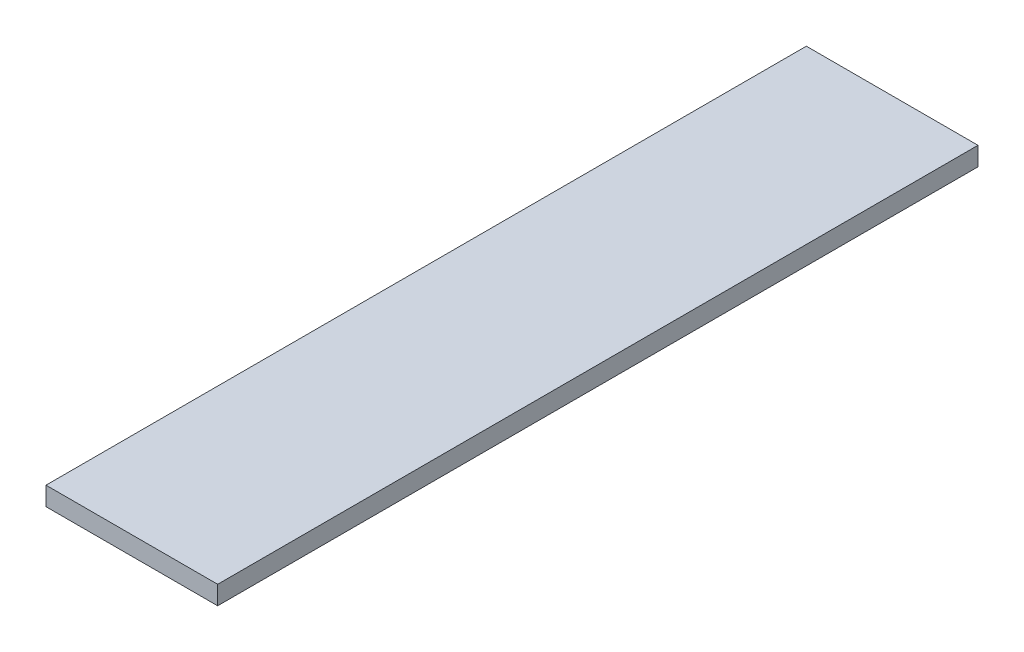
ISO-10303-21;
HEADER;
FILE_DESCRIPTION(('STEP AP214'),'2;1');
FILE_NAME('part.step','',(''),(''),'','','');
FILE_SCHEMA(('AUTOMOTIVE_DESIGN { 1 0 10303 214 1 1 1 1 }'));
ENDSEC;
DATA;
#1=APPLICATION_CONTEXT('core data for automotive mechanical design processes');
#2=APPLICATION_PROTOCOL_DEFINITION('international standard','automotive_design',2000,#1);
#3=PRODUCT_CONTEXT('',#1,'mechanical');
#4=PRODUCT('Part','Part','',(#3));
#5=PRODUCT_RELATED_PRODUCT_CATEGORY('part','',(#4));
#6=PRODUCT_DEFINITION_FORMATION('','',#4);
#7=PRODUCT_DEFINITION_CONTEXT('part definition',#1,'design');
#8=PRODUCT_DEFINITION('design','',#6,#7);
#9=PRODUCT_DEFINITION_SHAPE('','',#8);
#10=(LENGTH_UNIT() NAMED_UNIT(*) SI_UNIT(.MILLI.,.METRE.));
#11=(NAMED_UNIT(*) PLANE_ANGLE_UNIT() SI_UNIT($,.RADIAN.));
#12=(NAMED_UNIT(*) SI_UNIT($,.STERADIAN.) SOLID_ANGLE_UNIT());
#13=UNCERTAINTY_MEASURE_WITH_UNIT(LENGTH_MEASURE(1.E-05),#10,'distance_accuracy_value','');
#14=(GEOMETRIC_REPRESENTATION_CONTEXT(3) GLOBAL_UNCERTAINTY_ASSIGNED_CONTEXT((#13)) GLOBAL_UNIT_ASSIGNED_CONTEXT((#10,
#11,#12)) REPRESENTATION_CONTEXT('',''));
#15=CARTESIAN_POINT('',(0.,0.,0.));
#16=DIRECTION('',(0.,0.,1.));
#17=DIRECTION('',(1.,0.,0.));
#18=AXIS2_PLACEMENT_3D('',#15,#16,#17);
#19=CARTESIAN_POINT('',(584.2,127.,-2587.625));
#20=DIRECTION('',(-1.,0.,0.));
#21=DIRECTION('',(0.,0.,1.));
#22=AXIS2_PLACEMENT_3D('',#19,#20,#21);
#23=PLANE('',#22);
#24=DIRECTION('',(0.,0.,-1.));
#25=VECTOR('',#24,1.);
#26=CARTESIAN_POINT('',(584.2,0.,-2587.625));
#27=LINE('',#26,#25);
#28=CARTESIAN_POINT('',(584.2,0.,2587.625));
#29=VERTEX_POINT('',#28);
#30=CARTESIAN_POINT('',(584.2,0.,-2587.625));
#31=VERTEX_POINT('',#30);
#32=EDGE_CURVE('E97',#29,#31,#27,.T.);
#33=ORIENTED_EDGE('',*,*,#32,.T.);
#34=DIRECTION('',(0.,-1.,0.));
#35=VECTOR('',#34,1.);
#36=CARTESIAN_POINT('',(584.2,127.,-2587.625));
#37=LINE('',#36,#35);
#38=CARTESIAN_POINT('',(584.2,127.,-2587.625));
#39=VERTEX_POINT('',#38);
#40=EDGE_CURVE('E11',#39,#31,#37,.T.);
#41=ORIENTED_EDGE('',*,*,#40,.F.);
#42=DIRECTION('',(0.,0.,-1.));
#43=VECTOR('',#42,1.);
#44=CARTESIAN_POINT('',(584.2,127.,-2587.625));
#45=LINE('',#44,#43);
#46=CARTESIAN_POINT('',(584.2,127.,2587.625));
#47=VERTEX_POINT('',#46);
#48=EDGE_CURVE('E85',#47,#39,#45,.T.);
#49=ORIENTED_EDGE('',*,*,#48,.F.);
#50=DIRECTION('',(0.,-1.,0.));
#51=VECTOR('',#50,1.);
#52=CARTESIAN_POINT('',(584.2,127.,2587.625));
#53=LINE('',#52,#51);
#54=EDGE_CURVE('E93',#47,#29,#53,.T.);
#55=ORIENTED_EDGE('',*,*,#54,.T.);
#56=EDGE_LOOP('',(#33,#41,#49,#55));
#57=FACE_BOUND('',#56,.T.);
#58=ADVANCED_FACE('F34',(#57),#23,.F.);
#59=CARTESIAN_POINT('',(-584.2,127.,-2587.625));
#60=DIRECTION('',(0.,0.,1.));
#61=DIRECTION('',(1.,0.,0.));
#62=AXIS2_PLACEMENT_3D('',#59,#60,#61);
#63=PLANE('',#62);
#64=DIRECTION('',(-1.,0.,0.));
#65=VECTOR('',#64,1.);
#66=CARTESIAN_POINT('',(-584.2,0.,-2587.625));
#67=LINE('',#66,#65);
#68=CARTESIAN_POINT('',(-584.2,0.,-2587.625));
#69=VERTEX_POINT('',#68);
#70=EDGE_CURVE('E89',#31,#69,#67,.T.);
#71=ORIENTED_EDGE('',*,*,#70,.T.);
#72=DIRECTION('',(0.,-1.,0.));
#73=VECTOR('',#72,1.);
#74=CARTESIAN_POINT('',(-584.2,127.,-2587.625));
#75=LINE('',#74,#73);
#76=CARTESIAN_POINT('',(-584.2,127.,-2587.625));
#77=VERTEX_POINT('',#76);
#78=EDGE_CURVE('E42',#77,#69,#75,.T.);
#79=ORIENTED_EDGE('',*,*,#78,.F.);
#80=DIRECTION('',(-1.,0.,0.));
#81=VECTOR('',#80,1.);
#82=CARTESIAN_POINT('',(-584.2,127.,-2587.625));
#83=LINE('',#82,#81);
#84=EDGE_CURVE('E80',#39,#77,#83,.T.);
#85=ORIENTED_EDGE('',*,*,#84,.F.);
#86=ORIENTED_EDGE('',*,*,#40,.T.);
#87=EDGE_LOOP('',(#71,#79,#85,#86));
#88=FACE_BOUND('',#87,.T.);
#89=ADVANCED_FACE('F88',(#88),#63,.F.);
#90=CARTESIAN_POINT('',(-584.2,127.,-2587.625));
#91=DIRECTION('',(1.,0.,0.));
#92=DIRECTION('',(0.,0.,-1.));
#93=AXIS2_PLACEMENT_3D('',#90,#91,#92);
#94=PLANE('',#93);
#95=DIRECTION('',(0.,0.,1.));
#96=VECTOR('',#95,1.);
#97=CARTESIAN_POINT('',(-584.2,0.,-2587.625));
#98=LINE('',#97,#96);
#99=CARTESIAN_POINT('',(-584.2,0.,2587.625));
#100=VERTEX_POINT('',#99);
#101=EDGE_CURVE('E67',#69,#100,#98,.T.);
#102=ORIENTED_EDGE('',*,*,#101,.T.);
#103=DIRECTION('',(0.,-1.,0.));
#104=VECTOR('',#103,1.);
#105=CARTESIAN_POINT('',(-584.2,127.,2587.625));
#106=LINE('',#105,#104);
#107=CARTESIAN_POINT('',(-584.2,127.,2587.625));
#108=VERTEX_POINT('',#107);
#109=EDGE_CURVE('E90',#108,#100,#106,.T.);
#110=ORIENTED_EDGE('',*,*,#109,.F.);
#111=DIRECTION('',(0.,0.,1.));
#112=VECTOR('',#111,1.);
#113=CARTESIAN_POINT('',(-584.2,127.,-2587.625));
#114=LINE('',#113,#112);
#115=EDGE_CURVE('E83',#77,#108,#114,.T.);
#116=ORIENTED_EDGE('',*,*,#115,.F.);
#117=ORIENTED_EDGE('',*,*,#78,.T.);
#118=EDGE_LOOP('',(#102,#110,#116,#117));
#119=FACE_BOUND('',#118,.T.);
#120=ADVANCED_FACE('F91',(#119),#94,.F.);
#121=CARTESIAN_POINT('',(-584.2,127.,2587.625));
#122=DIRECTION('',(0.,0.,-1.));
#123=DIRECTION('',(-1.,0.,0.));
#124=AXIS2_PLACEMENT_3D('',#121,#122,#123);
#125=PLANE('',#124);
#126=DIRECTION('',(1.,0.,0.));
#127=VECTOR('',#126,1.);
#128=CARTESIAN_POINT('',(-584.2,0.,2587.625));
#129=LINE('',#128,#127);
#130=EDGE_CURVE('E73',#100,#29,#129,.T.);
#131=ORIENTED_EDGE('',*,*,#130,.T.);
#132=ORIENTED_EDGE('',*,*,#54,.F.);
#133=DIRECTION('',(1.,0.,0.));
#134=VECTOR('',#133,1.);
#135=CARTESIAN_POINT('',(-584.2,127.,2587.625));
#136=LINE('',#135,#134);
#137=EDGE_CURVE('E50',#108,#47,#136,.T.);
#138=ORIENTED_EDGE('',*,*,#137,.F.);
#139=ORIENTED_EDGE('',*,*,#109,.T.);
#140=EDGE_LOOP('',(#131,#132,#138,#139));
#141=FACE_BOUND('',#140,.T.);
#142=ADVANCED_FACE('F105',(#141),#125,.F.);
#143=CARTESIAN_POINT('',(584.2,127.,2587.625));
#144=DIRECTION('',(0.,1.,0.));
#145=DIRECTION('',(0.,0.,1.));
#146=AXIS2_PLACEMENT_3D('',#143,#144,#145);
#147=PLANE('',#146);
#148=ORIENTED_EDGE('',*,*,#48,.T.);
#149=ORIENTED_EDGE('',*,*,#84,.T.);
#150=ORIENTED_EDGE('',*,*,#115,.T.);
#151=ORIENTED_EDGE('',*,*,#137,.T.);
#152=EDGE_LOOP('',(#148,#149,#150,#151));
#153=FACE_BOUND('',#152,.T.);
#154=ADVANCED_FACE('F81',(#153),#147,.T.);
#155=CARTESIAN_POINT('',(584.2,0.,2587.625));
#156=DIRECTION('',(0.,1.,0.));
#157=DIRECTION('',(0.,0.,1.));
#158=AXIS2_PLACEMENT_3D('',#155,#156,#157);
#159=PLANE('',#158);
#160=ORIENTED_EDGE('',*,*,#32,.F.);
#161=ORIENTED_EDGE('',*,*,#130,.F.);
#162=ORIENTED_EDGE('',*,*,#101,.F.);
#163=ORIENTED_EDGE('',*,*,#70,.F.);
#164=EDGE_LOOP('',(#160,#161,#162,#163));
#165=FACE_BOUND('',#164,.T.);
#166=ADVANCED_FACE('F108',(#165),#159,.F.);
#167=CLOSED_SHELL('',(#58,#89,#120,#142,#154,#166));
#168=MANIFOLD_SOLID_BREP('B2',#167);
#169=ADVANCED_BREP_SHAPE_REPRESENTATION('',(#18,#168),#14);
#170=SHAPE_DEFINITION_REPRESENTATION(#9,#169);
ENDSEC;
END-ISO-10303-21;
